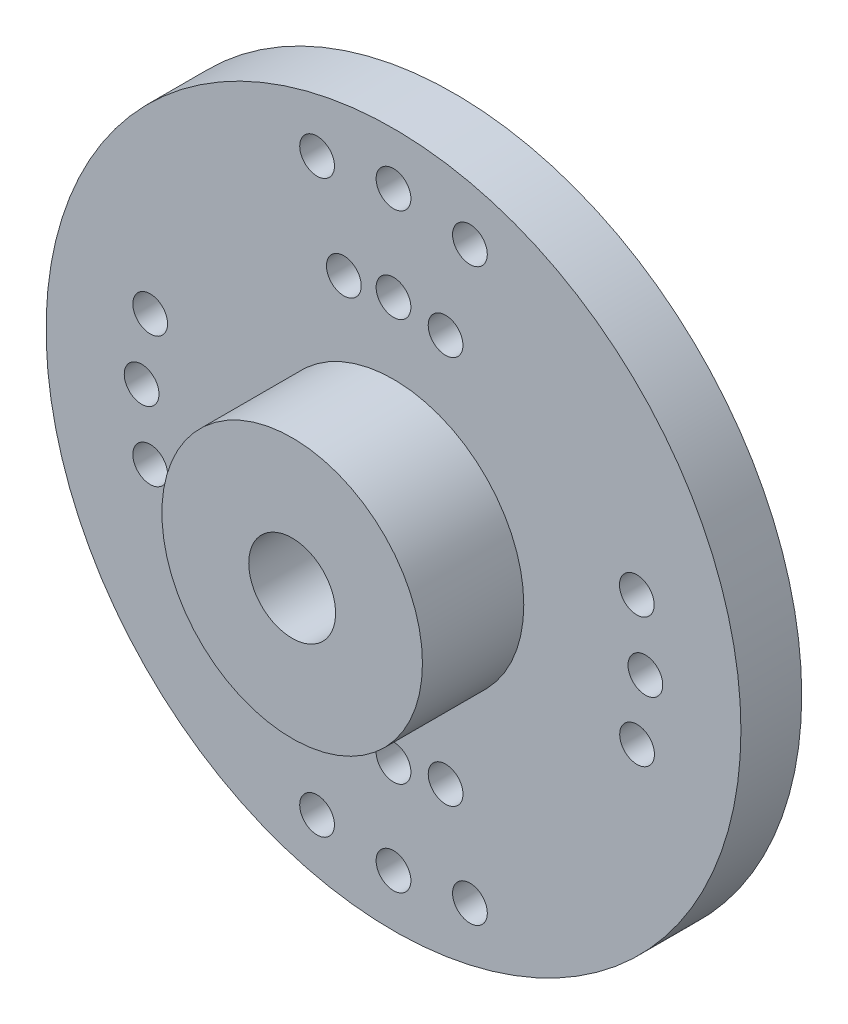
ISO-10303-21;
HEADER;
FILE_DESCRIPTION(('STEP AP214'),'2;1');
FILE_NAME('part.step','',(''),(''),'','','');
FILE_SCHEMA(('AUTOMOTIVE_DESIGN { 1 0 10303 214 1 1 1 1 }'));
ENDSEC;
DATA;
#1=APPLICATION_CONTEXT('core data for automotive mechanical design processes');
#2=APPLICATION_PROTOCOL_DEFINITION('international standard','automotive_design',2000,#1);
#3=PRODUCT_CONTEXT('',#1,'mechanical');
#4=PRODUCT('Part','Part','',(#3));
#5=PRODUCT_RELATED_PRODUCT_CATEGORY('part','',(#4));
#6=PRODUCT_DEFINITION_FORMATION('','',#4);
#7=PRODUCT_DEFINITION_CONTEXT('part definition',#1,'design');
#8=PRODUCT_DEFINITION('design','',#6,#7);
#9=PRODUCT_DEFINITION_SHAPE('','',#8);
#10=(LENGTH_UNIT() NAMED_UNIT(*) SI_UNIT(.MILLI.,.METRE.));
#11=(NAMED_UNIT(*) PLANE_ANGLE_UNIT() SI_UNIT($,.RADIAN.));
#12=(NAMED_UNIT(*) SI_UNIT($,.STERADIAN.) SOLID_ANGLE_UNIT());
#13=UNCERTAINTY_MEASURE_WITH_UNIT(LENGTH_MEASURE(1.E-05),#10,'distance_accuracy_value','');
#14=(GEOMETRIC_REPRESENTATION_CONTEXT(3) GLOBAL_UNCERTAINTY_ASSIGNED_CONTEXT((#13)) GLOBAL_UNIT_ASSIGNED_CONTEXT((#10,
#11,#12)) REPRESENTATION_CONTEXT('',''));
#15=CARTESIAN_POINT('',(0.,0.,0.));
#16=DIRECTION('',(0.,0.,1.));
#17=DIRECTION('',(1.,0.,0.));
#18=AXIS2_PLACEMENT_3D('',#15,#16,#17);
#19=CARTESIAN_POINT('',(0.,0.,2.1));
#20=DIRECTION('',(0.,0.,1.));
#21=DIRECTION('',(1.,0.,0.));
#22=AXIS2_PLACEMENT_3D('',#19,#20,#21);
#23=PLANE('',#22);
#24=CARTESIAN_POINT('',(-8.40340375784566,-2.25187357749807,2.1));
#25=DIRECTION('',(0.,0.,1.));
#26=DIRECTION('',(1.,0.,0.));
#27=AXIS2_PLACEMENT_3D('',#24,#25,#26);
#28=CIRCLE('',#27,0.6);
#29=CARTESIAN_POINT('',(-7.80340375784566,-2.25187357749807,2.1));
#30=VERTEX_POINT('',#29);
#31=EDGE_CURVE('E159',#30,#30,#28,.T.);
#32=ORIENTED_EDGE('',*,*,#31,.F.);
#33=EDGE_LOOP('',(#32));
#34=FACE_BOUND('',#33,.T.);
#35=CARTESIAN_POINT('',(-8.69989248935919,0.,2.1));
#36=DIRECTION('',(0.,0.,1.));
#37=DIRECTION('',(1.,0.,0.));
#38=AXIS2_PLACEMENT_3D('',#35,#36,#37);
#39=CIRCLE('',#38,0.6);
#40=CARTESIAN_POINT('',(-8.09989248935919,0.,2.1));
#41=VERTEX_POINT('',#40);
#42=EDGE_CURVE('E153',#41,#41,#39,.T.);
#43=ORIENTED_EDGE('',*,*,#42,.F.);
#44=EDGE_LOOP('',(#43));
#45=FACE_BOUND('',#44,.T.);
#46=CARTESIAN_POINT('',(-8.40326249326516,2.25240067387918,2.1));
#47=DIRECTION('',(0.,0.,1.));
#48=DIRECTION('',(1.,0.,0.));
#49=AXIS2_PLACEMENT_3D('',#46,#47,#48);
#50=CIRCLE('',#49,0.6);
#51=CARTESIAN_POINT('',(-7.80326249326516,2.25240067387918,2.1));
#52=VERTEX_POINT('',#51);
#53=EDGE_CURVE('E147',#52,#52,#50,.T.);
#54=ORIENTED_EDGE('',*,*,#53,.F.);
#55=EDGE_LOOP('',(#54));
#56=FACE_BOUND('',#55,.T.);
#57=CARTESIAN_POINT('',(8.41239817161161,-2.21803659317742,2.1));
#58=DIRECTION('',(0.,0.,1.));
#59=DIRECTION('',(1.,0.,0.));
#60=AXIS2_PLACEMENT_3D('',#57,#58,#59);
#61=CIRCLE('',#60,0.6);
#62=CARTESIAN_POINT('',(9.01239817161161,-2.21803659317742,2.1));
#63=VERTEX_POINT('',#62);
#64=EDGE_CURVE('E141',#63,#63,#61,.T.);
#65=ORIENTED_EDGE('',*,*,#64,.F.);
#66=EDGE_LOOP('',(#65));
#67=FACE_BOUND('',#66,.T.);
#68=CARTESIAN_POINT('',(8.69989248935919,0.,2.1));
#69=DIRECTION('',(0.,0.,1.));
#70=DIRECTION('',(1.,0.,0.));
#71=AXIS2_PLACEMENT_3D('',#68,#69,#70);
#72=CIRCLE('',#71,0.6);
#73=CARTESIAN_POINT('',(9.29989248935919,0.,2.1));
#74=VERTEX_POINT('',#73);
#75=EDGE_CURVE('E135',#74,#74,#72,.T.);
#76=ORIENTED_EDGE('',*,*,#75,.F.);
#77=EDGE_LOOP('',(#76));
#78=FACE_BOUND('',#77,.T.);
#79=CARTESIAN_POINT('',(8.40349792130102,2.25152215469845,2.1));
#80=DIRECTION('',(0.,0.,1.));
#81=DIRECTION('',(1.,0.,0.));
#82=AXIS2_PLACEMENT_3D('',#79,#80,#81);
#83=CIRCLE('',#82,0.6);
#84=CARTESIAN_POINT('',(9.00349792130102,2.25152215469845,2.1));
#85=VERTEX_POINT('',#84);
#86=EDGE_CURVE('E129',#85,#85,#83,.T.);
#87=ORIENTED_EDGE('',*,*,#86,.F.);
#88=EDGE_LOOP('',(#87));
#89=FACE_BOUND('',#88,.T.);
#90=CARTESIAN_POINT('',(0.,-6.95,2.1));
#91=DIRECTION('',(0.,0.,1.));
#92=DIRECTION('',(1.,0.,0.));
#93=AXIS2_PLACEMENT_3D('',#90,#91,#92);
#94=CIRCLE('',#93,0.6);
#95=CARTESIAN_POINT('',(0.6,-6.95,2.1));
#96=VERTEX_POINT('',#95);
#97=EDGE_CURVE('E123',#96,#96,#94,.T.);
#98=ORIENTED_EDGE('',*,*,#97,.F.);
#99=EDGE_LOOP('',(#98));
#100=FACE_BOUND('',#99,.T.);
#101=CARTESIAN_POINT('',(-1.79880921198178,-6.71317997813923,2.1));
#102=DIRECTION('',(0.,0.,1.));
#103=DIRECTION('',(1.,0.,0.));
#104=AXIS2_PLACEMENT_3D('',#101,#102,#103);
#105=CIRCLE('',#104,0.6);
#106=CARTESIAN_POINT('',(-1.19880921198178,-6.71317997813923,2.1));
#107=VERTEX_POINT('',#106);
#108=EDGE_CURVE('E117',#107,#107,#105,.T.);
#109=ORIENTED_EDGE('',*,*,#108,.F.);
#110=EDGE_LOOP('',(#109));
#111=FACE_BOUND('',#110,.T.);
#112=CARTESIAN_POINT('',(1.79919537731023,-6.71307649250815,2.1));
#113=DIRECTION('',(0.,0.,1.));
#114=DIRECTION('',(1.,0.,0.));
#115=AXIS2_PLACEMENT_3D('',#112,#113,#114);
#116=CIRCLE('',#115,0.6);
#117=CARTESIAN_POINT('',(2.39919537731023,-6.71307649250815,2.1));
#118=VERTEX_POINT('',#117);
#119=EDGE_CURVE('E111',#118,#118,#116,.T.);
#120=ORIENTED_EDGE('',*,*,#119,.F.);
#121=EDGE_LOOP('',(#120));
#122=FACE_BOUND('',#121,.T.);
#123=CARTESIAN_POINT('',(-1.71522814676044,6.73501985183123,2.1));
#124=DIRECTION('',(0.,0.,1.));
#125=DIRECTION('',(1.,0.,0.));
#126=AXIS2_PLACEMENT_3D('',#123,#124,#125);
#127=CIRCLE('',#126,0.6);
#128=CARTESIAN_POINT('',(-1.11522814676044,6.73501985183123,2.1));
#129=VERTEX_POINT('',#128);
#130=EDGE_CURVE('E105',#129,#129,#127,.T.);
#131=ORIENTED_EDGE('',*,*,#130,.F.);
#132=EDGE_LOOP('',(#131));
#133=FACE_BOUND('',#132,.T.);
#134=CARTESIAN_POINT('',(0.,6.95,2.1));
#135=DIRECTION('',(0.,0.,1.));
#136=DIRECTION('',(1.,0.,0.));
#137=AXIS2_PLACEMENT_3D('',#134,#135,#136);
#138=CIRCLE('',#137,0.6);
#139=CARTESIAN_POINT('',(0.6,6.95,2.1));
#140=VERTEX_POINT('',#139);
#141=EDGE_CURVE('E99',#140,#140,#138,.T.);
#142=ORIENTED_EDGE('',*,*,#141,.F.);
#143=EDGE_LOOP('',(#142));
#144=FACE_BOUND('',#143,.T.);
#145=CARTESIAN_POINT('',(1.79877551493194,6.71318900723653,2.1));
#146=DIRECTION('',(0.,0.,1.));
#147=DIRECTION('',(1.,0.,0.));
#148=AXIS2_PLACEMENT_3D('',#145,#146,#147);
#149=CIRCLE('',#148,0.6);
#150=CARTESIAN_POINT('',(2.39877551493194,6.71318900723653,2.1));
#151=VERTEX_POINT('',#150);
#152=EDGE_CURVE('E93',#151,#151,#149,.T.);
#153=ORIENTED_EDGE('',*,*,#152,.F.);
#154=EDGE_LOOP('',(#153));
#155=FACE_BOUND('',#154,.T.);
#156=CARTESIAN_POINT('',(-2.63997110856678,-9.85243891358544,2.1));
#157=DIRECTION('',(0.,0.,1.));
#158=DIRECTION('',(1.,0.,0.));
#159=AXIS2_PLACEMENT_3D('',#156,#157,#158);
#160=CIRCLE('',#159,0.6);
#161=CARTESIAN_POINT('',(-2.03997110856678,-9.85243891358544,2.1));
#162=VERTEX_POINT('',#161);
#163=EDGE_CURVE('E87',#162,#162,#160,.T.);
#164=ORIENTED_EDGE('',*,*,#163,.F.);
#165=EDGE_LOOP('',(#164));
#166=FACE_BOUND('',#165,.T.);
#167=CARTESIAN_POINT('',(0.,-10.2,2.1));
#168=DIRECTION('',(0.,0.,1.));
#169=DIRECTION('',(1.,0.,0.));
#170=AXIS2_PLACEMENT_3D('',#167,#168,#169);
#171=CIRCLE('',#170,0.6);
#172=CARTESIAN_POINT('',(0.599999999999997,-10.2,2.1));
#173=VERTEX_POINT('',#172);
#174=EDGE_CURVE('E81',#173,#173,#171,.T.);
#175=ORIENTED_EDGE('',*,*,#174,.F.);
#176=EDGE_LOOP('',(#175));
#177=FACE_BOUND('',#176,.T.);
#178=CARTESIAN_POINT('',(2.64035727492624,-9.85233543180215,2.1));
#179=DIRECTION('',(0.,0.,1.));
#180=DIRECTION('',(1.,0.,0.));
#181=AXIS2_PLACEMENT_3D('',#178,#179,#180);
#182=CIRCLE('',#181,0.6);
#183=CARTESIAN_POINT('',(3.24035727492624,-9.85233543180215,2.1));
#184=VERTEX_POINT('',#183);
#185=EDGE_CURVE('E75',#184,#184,#182,.T.);
#186=ORIENTED_EDGE('',*,*,#185,.F.);
#187=EDGE_LOOP('',(#186));
#188=FACE_BOUND('',#187,.T.);
#189=CARTESIAN_POINT('',(-2.63955124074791,9.8525514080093,2.1));
#190=DIRECTION('',(0.,0.,1.));
#191=DIRECTION('',(1.,0.,0.));
#192=AXIS2_PLACEMENT_3D('',#189,#190,#191);
#193=CIRCLE('',#192,0.6);
#194=CARTESIAN_POINT('',(-2.03955124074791,9.8525514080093,2.1));
#195=VERTEX_POINT('',#194);
#196=EDGE_CURVE('E69',#195,#195,#193,.T.);
#197=ORIENTED_EDGE('',*,*,#196,.F.);
#198=EDGE_LOOP('',(#197));
#199=FACE_BOUND('',#198,.T.);
#200=CARTESIAN_POINT('',(0.,10.2,2.1));
#201=DIRECTION('',(0.,0.,1.));
#202=DIRECTION('',(1.,0.,0.));
#203=AXIS2_PLACEMENT_3D('',#200,#201,#202);
#204=CIRCLE('',#203,0.6);
#205=CARTESIAN_POINT('',(0.6,10.2,2.1));
#206=VERTEX_POINT('',#205);
#207=EDGE_CURVE('E63',#206,#206,#204,.T.);
#208=ORIENTED_EDGE('',*,*,#207,.F.);
#209=EDGE_LOOP('',(#208));
#210=FACE_BOUND('',#209,.T.);
#211=CARTESIAN_POINT('',(2.63993741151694,9.85244794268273,2.1));
#212=DIRECTION('',(0.,0.,1.));
#213=DIRECTION('',(1.,0.,0.));
#214=AXIS2_PLACEMENT_3D('',#211,#212,#213);
#215=CIRCLE('',#214,0.6);
#216=CARTESIAN_POINT('',(3.23993741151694,9.85244794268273,2.1));
#217=VERTEX_POINT('',#216);
#218=EDGE_CURVE('E57',#217,#217,#215,.T.);
#219=ORIENTED_EDGE('',*,*,#218,.F.);
#220=EDGE_LOOP('',(#219));
#221=FACE_BOUND('',#220,.T.);
#222=CARTESIAN_POINT('',(0.,0.,2.1));
#223=DIRECTION('',(0.,0.,1.));
#224=DIRECTION('',(1.,0.,0.));
#225=AXIS2_PLACEMENT_3D('',#222,#223,#224);
#226=CIRCLE('',#225,12.);
#227=CARTESIAN_POINT('',(12.,0.,2.1));
#228=VERTEX_POINT('',#227);
#229=EDGE_CURVE('E10',#228,#228,#226,.T.);
#230=ORIENTED_EDGE('',*,*,#229,.T.);
#231=EDGE_LOOP('',(#230));
#232=FACE_BOUND('',#231,.T.);
#233=CARTESIAN_POINT('',(0.,0.,2.1));
#234=DIRECTION('',(0.,0.,1.));
#235=DIRECTION('',(1.,0.,0.));
#236=AXIS2_PLACEMENT_3D('',#233,#234,#235);
#237=CIRCLE('',#236,4.5);
#238=CARTESIAN_POINT('',(4.5,0.,2.1));
#239=VERTEX_POINT('',#238);
#240=EDGE_CURVE('E46',#239,#239,#237,.T.);
#241=ORIENTED_EDGE('',*,*,#240,.F.);
#242=EDGE_LOOP('',(#241));
#243=FACE_BOUND('',#242,.T.);
#244=ADVANCED_FACE('F31',(#34,#45,#56,#67,#78,#89,#100,#111,#122,#133,#144,#155,#166,#177,#188,
#199,#210,#221,#232,#243),#23,.T.);
#245=CARTESIAN_POINT('',(0.,0.,2.1));
#246=DIRECTION('',(0.,0.,-1.));
#247=DIRECTION('',(-1.,0.,0.));
#248=AXIS2_PLACEMENT_3D('',#245,#246,#247);
#249=CYLINDRICAL_SURFACE('',#248,12.);
#250=ORIENTED_EDGE('',*,*,#229,.F.);
#251=EDGE_LOOP('',(#250));
#252=FACE_BOUND('',#251,.T.);
#253=CARTESIAN_POINT('',(0.,0.,0.));
#254=DIRECTION('',(0.,0.,1.));
#255=DIRECTION('',(1.,0.,0.));
#256=AXIS2_PLACEMENT_3D('',#253,#254,#255);
#257=CIRCLE('',#256,12.);
#258=CARTESIAN_POINT('',(12.,0.,0.));
#259=VERTEX_POINT('',#258);
#260=EDGE_CURVE('E38',#259,#259,#257,.T.);
#261=ORIENTED_EDGE('',*,*,#260,.T.);
#262=EDGE_LOOP('',(#261));
#263=FACE_BOUND('',#262,.T.);
#264=ADVANCED_FACE('F33',(#252,#263),#249,.T.);
#265=CARTESIAN_POINT('',(0.,0.,0.));
#266=DIRECTION('',(0.,0.,1.));
#267=DIRECTION('',(1.,0.,0.));
#268=AXIS2_PLACEMENT_3D('',#265,#266,#267);
#269=PLANE('',#268);
#270=CARTESIAN_POINT('',(-8.40340375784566,-2.25187357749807,0.));
#271=DIRECTION('',(0.,0.,-1.));
#272=DIRECTION('',(-1.,0.,0.));
#273=AXIS2_PLACEMENT_3D('',#270,#271,#272);
#274=CIRCLE('',#273,0.6);
#275=CARTESIAN_POINT('',(-9.00340375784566,-2.25187357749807,0.));
#276=VERTEX_POINT('',#275);
#277=EDGE_CURVE('E162',#276,#276,#274,.T.);
#278=ORIENTED_EDGE('',*,*,#277,.F.);
#279=EDGE_LOOP('',(#278));
#280=FACE_BOUND('',#279,.T.);
#281=CARTESIAN_POINT('',(-8.69989248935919,0.,0.));
#282=DIRECTION('',(0.,0.,-1.));
#283=DIRECTION('',(-1.,0.,0.));
#284=AXIS2_PLACEMENT_3D('',#281,#282,#283);
#285=CIRCLE('',#284,0.6);
#286=CARTESIAN_POINT('',(-9.29989248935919,0.,0.));
#287=VERTEX_POINT('',#286);
#288=EDGE_CURVE('E156',#287,#287,#285,.T.);
#289=ORIENTED_EDGE('',*,*,#288,.F.);
#290=EDGE_LOOP('',(#289));
#291=FACE_BOUND('',#290,.T.);
#292=CARTESIAN_POINT('',(-8.40326249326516,2.25240067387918,0.));
#293=DIRECTION('',(0.,0.,-1.));
#294=DIRECTION('',(-1.,0.,0.));
#295=AXIS2_PLACEMENT_3D('',#292,#293,#294);
#296=CIRCLE('',#295,0.6);
#297=CARTESIAN_POINT('',(-9.00326249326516,2.25240067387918,0.));
#298=VERTEX_POINT('',#297);
#299=EDGE_CURVE('E150',#298,#298,#296,.T.);
#300=ORIENTED_EDGE('',*,*,#299,.F.);
#301=EDGE_LOOP('',(#300));
#302=FACE_BOUND('',#301,.T.);
#303=CARTESIAN_POINT('',(8.41239817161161,-2.21803659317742,0.));
#304=DIRECTION('',(0.,0.,-1.));
#305=DIRECTION('',(-1.,0.,0.));
#306=AXIS2_PLACEMENT_3D('',#303,#304,#305);
#307=CIRCLE('',#306,0.6);
#308=CARTESIAN_POINT('',(7.81239817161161,-2.21803659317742,0.));
#309=VERTEX_POINT('',#308);
#310=EDGE_CURVE('E144',#309,#309,#307,.T.);
#311=ORIENTED_EDGE('',*,*,#310,.F.);
#312=EDGE_LOOP('',(#311));
#313=FACE_BOUND('',#312,.T.);
#314=CARTESIAN_POINT('',(8.69989248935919,0.,0.));
#315=DIRECTION('',(0.,0.,-1.));
#316=DIRECTION('',(-1.,0.,0.));
#317=AXIS2_PLACEMENT_3D('',#314,#315,#316);
#318=CIRCLE('',#317,0.6);
#319=CARTESIAN_POINT('',(8.09989248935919,0.,0.));
#320=VERTEX_POINT('',#319);
#321=EDGE_CURVE('E138',#320,#320,#318,.T.);
#322=ORIENTED_EDGE('',*,*,#321,.F.);
#323=EDGE_LOOP('',(#322));
#324=FACE_BOUND('',#323,.T.);
#325=CARTESIAN_POINT('',(8.40349792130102,2.25152215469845,0.));
#326=DIRECTION('',(0.,0.,-1.));
#327=DIRECTION('',(-1.,0.,0.));
#328=AXIS2_PLACEMENT_3D('',#325,#326,#327);
#329=CIRCLE('',#328,0.6);
#330=CARTESIAN_POINT('',(7.80349792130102,2.25152215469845,0.));
#331=VERTEX_POINT('',#330);
#332=EDGE_CURVE('E132',#331,#331,#329,.T.);
#333=ORIENTED_EDGE('',*,*,#332,.F.);
#334=EDGE_LOOP('',(#333));
#335=FACE_BOUND('',#334,.T.);
#336=CARTESIAN_POINT('',(0.,-6.95,0.));
#337=DIRECTION('',(0.,0.,-1.));
#338=DIRECTION('',(-1.,0.,0.));
#339=AXIS2_PLACEMENT_3D('',#336,#337,#338);
#340=CIRCLE('',#339,0.6);
#341=CARTESIAN_POINT('',(-0.6,-6.95,0.));
#342=VERTEX_POINT('',#341);
#343=EDGE_CURVE('E126',#342,#342,#340,.T.);
#344=ORIENTED_EDGE('',*,*,#343,.F.);
#345=EDGE_LOOP('',(#344));
#346=FACE_BOUND('',#345,.T.);
#347=CARTESIAN_POINT('',(-1.79880921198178,-6.71317997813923,0.));
#348=DIRECTION('',(0.,0.,-1.));
#349=DIRECTION('',(-1.,0.,0.));
#350=AXIS2_PLACEMENT_3D('',#347,#348,#349);
#351=CIRCLE('',#350,0.6);
#352=CARTESIAN_POINT('',(-2.39880921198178,-6.71317997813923,0.));
#353=VERTEX_POINT('',#352);
#354=EDGE_CURVE('E120',#353,#353,#351,.T.);
#355=ORIENTED_EDGE('',*,*,#354,.F.);
#356=EDGE_LOOP('',(#355));
#357=FACE_BOUND('',#356,.T.);
#358=CARTESIAN_POINT('',(1.79919537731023,-6.71307649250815,0.));
#359=DIRECTION('',(0.,0.,-1.));
#360=DIRECTION('',(-1.,0.,0.));
#361=AXIS2_PLACEMENT_3D('',#358,#359,#360);
#362=CIRCLE('',#361,0.6);
#363=CARTESIAN_POINT('',(1.19919537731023,-6.71307649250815,0.));
#364=VERTEX_POINT('',#363);
#365=EDGE_CURVE('E114',#364,#364,#362,.T.);
#366=ORIENTED_EDGE('',*,*,#365,.F.);
#367=EDGE_LOOP('',(#366));
#368=FACE_BOUND('',#367,.T.);
#369=CARTESIAN_POINT('',(-1.71522814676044,6.73501985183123,0.));
#370=DIRECTION('',(0.,0.,-1.));
#371=DIRECTION('',(-1.,0.,0.));
#372=AXIS2_PLACEMENT_3D('',#369,#370,#371);
#373=CIRCLE('',#372,0.6);
#374=CARTESIAN_POINT('',(-2.31522814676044,6.73501985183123,0.));
#375=VERTEX_POINT('',#374);
#376=EDGE_CURVE('E108',#375,#375,#373,.T.);
#377=ORIENTED_EDGE('',*,*,#376,.F.);
#378=EDGE_LOOP('',(#377));
#379=FACE_BOUND('',#378,.T.);
#380=CARTESIAN_POINT('',(0.,6.95,0.));
#381=DIRECTION('',(0.,0.,-1.));
#382=DIRECTION('',(-1.,0.,0.));
#383=AXIS2_PLACEMENT_3D('',#380,#381,#382);
#384=CIRCLE('',#383,0.6);
#385=CARTESIAN_POINT('',(-0.6,6.95,0.));
#386=VERTEX_POINT('',#385);
#387=EDGE_CURVE('E102',#386,#386,#384,.T.);
#388=ORIENTED_EDGE('',*,*,#387,.F.);
#389=EDGE_LOOP('',(#388));
#390=FACE_BOUND('',#389,.T.);
#391=CARTESIAN_POINT('',(1.79877551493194,6.71318900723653,0.));
#392=DIRECTION('',(0.,0.,-1.));
#393=DIRECTION('',(-1.,0.,0.));
#394=AXIS2_PLACEMENT_3D('',#391,#392,#393);
#395=CIRCLE('',#394,0.6);
#396=CARTESIAN_POINT('',(1.19877551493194,6.71318900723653,0.));
#397=VERTEX_POINT('',#396);
#398=EDGE_CURVE('E96',#397,#397,#395,.T.);
#399=ORIENTED_EDGE('',*,*,#398,.F.);
#400=EDGE_LOOP('',(#399));
#401=FACE_BOUND('',#400,.T.);
#402=CARTESIAN_POINT('',(-2.63997110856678,-9.85243891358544,0.));
#403=DIRECTION('',(0.,0.,-1.));
#404=DIRECTION('',(-1.,0.,0.));
#405=AXIS2_PLACEMENT_3D('',#402,#403,#404);
#406=CIRCLE('',#405,0.6);
#407=CARTESIAN_POINT('',(-3.23997110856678,-9.85243891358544,0.));
#408=VERTEX_POINT('',#407);
#409=EDGE_CURVE('E90',#408,#408,#406,.T.);
#410=ORIENTED_EDGE('',*,*,#409,.F.);
#411=EDGE_LOOP('',(#410));
#412=FACE_BOUND('',#411,.T.);
#413=CARTESIAN_POINT('',(0.,-10.2,0.));
#414=DIRECTION('',(0.,0.,-1.));
#415=DIRECTION('',(-1.,0.,0.));
#416=AXIS2_PLACEMENT_3D('',#413,#414,#415);
#417=CIRCLE('',#416,0.6);
#418=CARTESIAN_POINT('',(-0.600000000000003,-10.2,0.));
#419=VERTEX_POINT('',#418);
#420=EDGE_CURVE('E84',#419,#419,#417,.T.);
#421=ORIENTED_EDGE('',*,*,#420,.F.);
#422=EDGE_LOOP('',(#421));
#423=FACE_BOUND('',#422,.T.);
#424=CARTESIAN_POINT('',(2.64035727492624,-9.85233543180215,0.));
#425=DIRECTION('',(0.,0.,-1.));
#426=DIRECTION('',(-1.,0.,0.));
#427=AXIS2_PLACEMENT_3D('',#424,#425,#426);
#428=CIRCLE('',#427,0.6);
#429=CARTESIAN_POINT('',(2.04035727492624,-9.85233543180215,0.));
#430=VERTEX_POINT('',#429);
#431=EDGE_CURVE('E78',#430,#430,#428,.T.);
#432=ORIENTED_EDGE('',*,*,#431,.F.);
#433=EDGE_LOOP('',(#432));
#434=FACE_BOUND('',#433,.T.);
#435=CARTESIAN_POINT('',(-2.63955124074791,9.8525514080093,0.));
#436=DIRECTION('',(0.,0.,-1.));
#437=DIRECTION('',(-1.,0.,0.));
#438=AXIS2_PLACEMENT_3D('',#435,#436,#437);
#439=CIRCLE('',#438,0.6);
#440=CARTESIAN_POINT('',(-3.23955124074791,9.8525514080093,0.));
#441=VERTEX_POINT('',#440);
#442=EDGE_CURVE('E72',#441,#441,#439,.T.);
#443=ORIENTED_EDGE('',*,*,#442,.F.);
#444=EDGE_LOOP('',(#443));
#445=FACE_BOUND('',#444,.T.);
#446=CARTESIAN_POINT('',(0.,10.2,0.));
#447=DIRECTION('',(0.,0.,-1.));
#448=DIRECTION('',(-1.,0.,0.));
#449=AXIS2_PLACEMENT_3D('',#446,#447,#448);
#450=CIRCLE('',#449,0.6);
#451=CARTESIAN_POINT('',(-0.6,10.2,0.));
#452=VERTEX_POINT('',#451);
#453=EDGE_CURVE('E66',#452,#452,#450,.T.);
#454=ORIENTED_EDGE('',*,*,#453,.F.);
#455=EDGE_LOOP('',(#454));
#456=FACE_BOUND('',#455,.T.);
#457=CARTESIAN_POINT('',(2.63993741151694,9.85244794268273,0.));
#458=DIRECTION('',(0.,0.,-1.));
#459=DIRECTION('',(-1.,0.,0.));
#460=AXIS2_PLACEMENT_3D('',#457,#458,#459);
#461=CIRCLE('',#460,0.6);
#462=CARTESIAN_POINT('',(2.03993741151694,9.85244794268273,0.));
#463=VERTEX_POINT('',#462);
#464=EDGE_CURVE('E60',#463,#463,#461,.T.);
#465=ORIENTED_EDGE('',*,*,#464,.F.);
#466=EDGE_LOOP('',(#465));
#467=FACE_BOUND('',#466,.T.);
#468=CARTESIAN_POINT('',(0.,0.,0.));
#469=DIRECTION('',(0.,0.,-1.));
#470=DIRECTION('',(-1.,0.,0.));
#471=AXIS2_PLACEMENT_3D('',#468,#469,#470);
#472=CIRCLE('',#471,1.5);
#473=CARTESIAN_POINT('',(-1.5,0.,0.));
#474=VERTEX_POINT('',#473);
#475=EDGE_CURVE('E54',#474,#474,#472,.T.);
#476=ORIENTED_EDGE('',*,*,#475,.F.);
#477=EDGE_LOOP('',(#476));
#478=FACE_BOUND('',#477,.T.);
#479=ORIENTED_EDGE('',*,*,#260,.F.);
#480=EDGE_LOOP('',(#479));
#481=FACE_BOUND('',#480,.T.);
#482=ADVANCED_FACE('F168',(#280,#291,#302,#313,#324,#335,#346,#357,#368,#379,#390,#401,#412,
#423,#434,#445,#456,#467,#478,#481),#269,.F.);
#483=CARTESIAN_POINT('',(0.,0.,5.6));
#484=DIRECTION('',(0.,0.,-1.));
#485=DIRECTION('',(-1.,0.,0.));
#486=AXIS2_PLACEMENT_3D('',#483,#484,#485);
#487=CYLINDRICAL_SURFACE('',#486,4.5);
#488=CARTESIAN_POINT('',(0.,0.,5.6));
#489=DIRECTION('',(0.,0.,1.));
#490=DIRECTION('',(1.,0.,0.));
#491=AXIS2_PLACEMENT_3D('',#488,#489,#490);
#492=CIRCLE('',#491,4.5);
#493=CARTESIAN_POINT('',(4.5,0.,5.6));
#494=VERTEX_POINT('',#493);
#495=EDGE_CURVE('E42',#494,#494,#492,.T.);
#496=ORIENTED_EDGE('',*,*,#495,.F.);
#497=EDGE_LOOP('',(#496));
#498=FACE_BOUND('',#497,.T.);
#499=ORIENTED_EDGE('',*,*,#240,.T.);
#500=EDGE_LOOP('',(#499));
#501=FACE_BOUND('',#500,.T.);
#502=ADVANCED_FACE('F171',(#498,#501),#487,.T.);
#503=CARTESIAN_POINT('',(0.,0.,5.6));
#504=DIRECTION('',(0.,0.,1.));
#505=DIRECTION('',(1.,0.,0.));
#506=AXIS2_PLACEMENT_3D('',#503,#504,#505);
#507=PLANE('',#506);
#508=CARTESIAN_POINT('',(0.,0.,5.6));
#509=DIRECTION('',(0.,0.,-1.));
#510=DIRECTION('',(-1.,0.,0.));
#511=AXIS2_PLACEMENT_3D('',#508,#509,#510);
#512=CIRCLE('',#511,1.5);
#513=CARTESIAN_POINT('',(-1.5,0.,5.6));
#514=VERTEX_POINT('',#513);
#515=EDGE_CURVE('E51',#514,#514,#512,.T.);
#516=ORIENTED_EDGE('',*,*,#515,.T.);
#517=EDGE_LOOP('',(#516));
#518=FACE_BOUND('',#517,.T.);
#519=ORIENTED_EDGE('',*,*,#495,.T.);
#520=EDGE_LOOP('',(#519));
#521=FACE_BOUND('',#520,.T.);
#522=ADVANCED_FACE('F213',(#518,#521),#507,.T.);
#523=CARTESIAN_POINT('',(0.,0.,5.6));
#524=DIRECTION('',(0.,0.,-1.));
#525=DIRECTION('',(-1.,0.,0.));
#526=AXIS2_PLACEMENT_3D('',#523,#524,#525);
#527=CYLINDRICAL_SURFACE('',#526,1.5);
#528=ORIENTED_EDGE('',*,*,#515,.F.);
#529=EDGE_LOOP('',(#528));
#530=FACE_BOUND('',#529,.T.);
#531=ORIENTED_EDGE('',*,*,#475,.T.);
#532=EDGE_LOOP('',(#531));
#533=FACE_BOUND('',#532,.T.);
#534=ADVANCED_FACE('F210',(#530,#533),#527,.F.);
#535=CARTESIAN_POINT('',(2.63993741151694,9.85244794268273,5.6));
#536=DIRECTION('',(0.,0.,-1.));
#537=DIRECTION('',(-1.,0.,0.));
#538=AXIS2_PLACEMENT_3D('',#535,#536,#537);
#539=CYLINDRICAL_SURFACE('',#538,0.6);
#540=ORIENTED_EDGE('',*,*,#218,.T.);
#541=EDGE_LOOP('',(#540));
#542=FACE_BOUND('',#541,.T.);
#543=ORIENTED_EDGE('',*,*,#464,.T.);
#544=EDGE_LOOP('',(#543));
#545=FACE_BOUND('',#544,.T.);
#546=ADVANCED_FACE('F212',(#542,#545),#539,.F.);
#547=CARTESIAN_POINT('',(0.,10.2,5.6));
#548=DIRECTION('',(0.,0.,-1.));
#549=DIRECTION('',(-1.,0.,0.));
#550=AXIS2_PLACEMENT_3D('',#547,#548,#549);
#551=CYLINDRICAL_SURFACE('',#550,0.6);
#552=ORIENTED_EDGE('',*,*,#207,.T.);
#553=EDGE_LOOP('',(#552));
#554=FACE_BOUND('',#553,.T.);
#555=ORIENTED_EDGE('',*,*,#453,.T.);
#556=EDGE_LOOP('',(#555));
#557=FACE_BOUND('',#556,.T.);
#558=ADVANCED_FACE('F220',(#554,#557),#551,.F.);
#559=CARTESIAN_POINT('',(-2.63955124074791,9.8525514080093,5.6));
#560=DIRECTION('',(0.,0.,-1.));
#561=DIRECTION('',(-1.,0.,0.));
#562=AXIS2_PLACEMENT_3D('',#559,#560,#561);
#563=CYLINDRICAL_SURFACE('',#562,0.6);
#564=ORIENTED_EDGE('',*,*,#196,.T.);
#565=EDGE_LOOP('',(#564));
#566=FACE_BOUND('',#565,.T.);
#567=ORIENTED_EDGE('',*,*,#442,.T.);
#568=EDGE_LOOP('',(#567));
#569=FACE_BOUND('',#568,.T.);
#570=ADVANCED_FACE('F272',(#566,#569),#563,.F.);
#571=CARTESIAN_POINT('',(2.64035727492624,-9.85233543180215,5.6));
#572=DIRECTION('',(0.,0.,-1.));
#573=DIRECTION('',(-1.,0.,0.));
#574=AXIS2_PLACEMENT_3D('',#571,#572,#573);
#575=CYLINDRICAL_SURFACE('',#574,0.6);
#576=ORIENTED_EDGE('',*,*,#185,.T.);
#577=EDGE_LOOP('',(#576));
#578=FACE_BOUND('',#577,.T.);
#579=ORIENTED_EDGE('',*,*,#431,.T.);
#580=EDGE_LOOP('',(#579));
#581=FACE_BOUND('',#580,.T.);
#582=ADVANCED_FACE('F282',(#578,#581),#575,.F.);
#583=CARTESIAN_POINT('',(0.,-10.2,5.6));
#584=DIRECTION('',(0.,0.,-1.));
#585=DIRECTION('',(-1.,0.,0.));
#586=AXIS2_PLACEMENT_3D('',#583,#584,#585);
#587=CYLINDRICAL_SURFACE('',#586,0.6);
#588=ORIENTED_EDGE('',*,*,#174,.T.);
#589=EDGE_LOOP('',(#588));
#590=FACE_BOUND('',#589,.T.);
#591=ORIENTED_EDGE('',*,*,#420,.T.);
#592=EDGE_LOOP('',(#591));
#593=FACE_BOUND('',#592,.T.);
#594=ADVANCED_FACE('F292',(#590,#593),#587,.F.);
#595=CARTESIAN_POINT('',(-2.63997110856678,-9.85243891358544,5.6));
#596=DIRECTION('',(0.,0.,-1.));
#597=DIRECTION('',(-1.,0.,0.));
#598=AXIS2_PLACEMENT_3D('',#595,#596,#597);
#599=CYLINDRICAL_SURFACE('',#598,0.6);
#600=ORIENTED_EDGE('',*,*,#163,.T.);
#601=EDGE_LOOP('',(#600));
#602=FACE_BOUND('',#601,.T.);
#603=ORIENTED_EDGE('',*,*,#409,.T.);
#604=EDGE_LOOP('',(#603));
#605=FACE_BOUND('',#604,.T.);
#606=ADVANCED_FACE('F302',(#602,#605),#599,.F.);
#607=CARTESIAN_POINT('',(1.79877551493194,6.71318900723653,5.6));
#608=DIRECTION('',(0.,0.,-1.));
#609=DIRECTION('',(-1.,0.,0.));
#610=AXIS2_PLACEMENT_3D('',#607,#608,#609);
#611=CYLINDRICAL_SURFACE('',#610,0.6);
#612=ORIENTED_EDGE('',*,*,#152,.T.);
#613=EDGE_LOOP('',(#612));
#614=FACE_BOUND('',#613,.T.);
#615=ORIENTED_EDGE('',*,*,#398,.T.);
#616=EDGE_LOOP('',(#615));
#617=FACE_BOUND('',#616,.T.);
#618=ADVANCED_FACE('F312',(#614,#617),#611,.F.);
#619=CARTESIAN_POINT('',(0.,6.95,5.6));
#620=DIRECTION('',(0.,0.,-1.));
#621=DIRECTION('',(-1.,0.,0.));
#622=AXIS2_PLACEMENT_3D('',#619,#620,#621);
#623=CYLINDRICAL_SURFACE('',#622,0.6);
#624=ORIENTED_EDGE('',*,*,#141,.T.);
#625=EDGE_LOOP('',(#624));
#626=FACE_BOUND('',#625,.T.);
#627=ORIENTED_EDGE('',*,*,#387,.T.);
#628=EDGE_LOOP('',(#627));
#629=FACE_BOUND('',#628,.T.);
#630=ADVANCED_FACE('F322',(#626,#629),#623,.F.);
#631=CARTESIAN_POINT('',(-1.71522814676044,6.73501985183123,5.6));
#632=DIRECTION('',(0.,0.,-1.));
#633=DIRECTION('',(-1.,0.,0.));
#634=AXIS2_PLACEMENT_3D('',#631,#632,#633);
#635=CYLINDRICAL_SURFACE('',#634,0.6);
#636=ORIENTED_EDGE('',*,*,#130,.T.);
#637=EDGE_LOOP('',(#636));
#638=FACE_BOUND('',#637,.T.);
#639=ORIENTED_EDGE('',*,*,#376,.T.);
#640=EDGE_LOOP('',(#639));
#641=FACE_BOUND('',#640,.T.);
#642=ADVANCED_FACE('F332',(#638,#641),#635,.F.);
#643=CARTESIAN_POINT('',(1.79919537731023,-6.71307649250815,5.6));
#644=DIRECTION('',(0.,0.,-1.));
#645=DIRECTION('',(-1.,0.,0.));
#646=AXIS2_PLACEMENT_3D('',#643,#644,#645);
#647=CYLINDRICAL_SURFACE('',#646,0.6);
#648=ORIENTED_EDGE('',*,*,#119,.T.);
#649=EDGE_LOOP('',(#648));
#650=FACE_BOUND('',#649,.T.);
#651=ORIENTED_EDGE('',*,*,#365,.T.);
#652=EDGE_LOOP('',(#651));
#653=FACE_BOUND('',#652,.T.);
#654=ADVANCED_FACE('F342',(#650,#653),#647,.F.);
#655=CARTESIAN_POINT('',(-1.79880921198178,-6.71317997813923,5.6));
#656=DIRECTION('',(0.,0.,-1.));
#657=DIRECTION('',(-1.,0.,0.));
#658=AXIS2_PLACEMENT_3D('',#655,#656,#657);
#659=CYLINDRICAL_SURFACE('',#658,0.6);
#660=ORIENTED_EDGE('',*,*,#108,.T.);
#661=EDGE_LOOP('',(#660));
#662=FACE_BOUND('',#661,.T.);
#663=ORIENTED_EDGE('',*,*,#354,.T.);
#664=EDGE_LOOP('',(#663));
#665=FACE_BOUND('',#664,.T.);
#666=ADVANCED_FACE('F352',(#662,#665),#659,.F.);
#667=CARTESIAN_POINT('',(0.,-6.95,5.6));
#668=DIRECTION('',(0.,0.,-1.));
#669=DIRECTION('',(-1.,0.,0.));
#670=AXIS2_PLACEMENT_3D('',#667,#668,#669);
#671=CYLINDRICAL_SURFACE('',#670,0.6);
#672=ORIENTED_EDGE('',*,*,#97,.T.);
#673=EDGE_LOOP('',(#672));
#674=FACE_BOUND('',#673,.T.);
#675=ORIENTED_EDGE('',*,*,#343,.T.);
#676=EDGE_LOOP('',(#675));
#677=FACE_BOUND('',#676,.T.);
#678=ADVANCED_FACE('F362',(#674,#677),#671,.F.);
#679=CARTESIAN_POINT('',(8.40349792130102,2.25152215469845,5.6));
#680=DIRECTION('',(0.,0.,-1.));
#681=DIRECTION('',(-1.,0.,0.));
#682=AXIS2_PLACEMENT_3D('',#679,#680,#681);
#683=CYLINDRICAL_SURFACE('',#682,0.6);
#684=ORIENTED_EDGE('',*,*,#86,.T.);
#685=EDGE_LOOP('',(#684));
#686=FACE_BOUND('',#685,.T.);
#687=ORIENTED_EDGE('',*,*,#332,.T.);
#688=EDGE_LOOP('',(#687));
#689=FACE_BOUND('',#688,.T.);
#690=ADVANCED_FACE('F372',(#686,#689),#683,.F.);
#691=CARTESIAN_POINT('',(8.69989248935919,0.,5.6));
#692=DIRECTION('',(0.,0.,-1.));
#693=DIRECTION('',(-1.,0.,0.));
#694=AXIS2_PLACEMENT_3D('',#691,#692,#693);
#695=CYLINDRICAL_SURFACE('',#694,0.6);
#696=ORIENTED_EDGE('',*,*,#75,.T.);
#697=EDGE_LOOP('',(#696));
#698=FACE_BOUND('',#697,.T.);
#699=ORIENTED_EDGE('',*,*,#321,.T.);
#700=EDGE_LOOP('',(#699));
#701=FACE_BOUND('',#700,.T.);
#702=ADVANCED_FACE('F382',(#698,#701),#695,.F.);
#703=CARTESIAN_POINT('',(8.41239817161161,-2.21803659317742,5.6));
#704=DIRECTION('',(0.,0.,-1.));
#705=DIRECTION('',(-1.,0.,0.));
#706=AXIS2_PLACEMENT_3D('',#703,#704,#705);
#707=CYLINDRICAL_SURFACE('',#706,0.6);
#708=ORIENTED_EDGE('',*,*,#64,.T.);
#709=EDGE_LOOP('',(#708));
#710=FACE_BOUND('',#709,.T.);
#711=ORIENTED_EDGE('',*,*,#310,.T.);
#712=EDGE_LOOP('',(#711));
#713=FACE_BOUND('',#712,.T.);
#714=ADVANCED_FACE('F392',(#710,#713),#707,.F.);
#715=CARTESIAN_POINT('',(-8.40326249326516,2.25240067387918,5.6));
#716=DIRECTION('',(0.,0.,-1.));
#717=DIRECTION('',(-1.,0.,0.));
#718=AXIS2_PLACEMENT_3D('',#715,#716,#717);
#719=CYLINDRICAL_SURFACE('',#718,0.6);
#720=ORIENTED_EDGE('',*,*,#53,.T.);
#721=EDGE_LOOP('',(#720));
#722=FACE_BOUND('',#721,.T.);
#723=ORIENTED_EDGE('',*,*,#299,.T.);
#724=EDGE_LOOP('',(#723));
#725=FACE_BOUND('',#724,.T.);
#726=ADVANCED_FACE('F402',(#722,#725),#719,.F.);
#727=CARTESIAN_POINT('',(-8.69989248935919,0.,5.6));
#728=DIRECTION('',(0.,0.,-1.));
#729=DIRECTION('',(-1.,0.,0.));
#730=AXIS2_PLACEMENT_3D('',#727,#728,#729);
#731=CYLINDRICAL_SURFACE('',#730,0.6);
#732=ORIENTED_EDGE('',*,*,#42,.T.);
#733=EDGE_LOOP('',(#732));
#734=FACE_BOUND('',#733,.T.);
#735=ORIENTED_EDGE('',*,*,#288,.T.);
#736=EDGE_LOOP('',(#735));
#737=FACE_BOUND('',#736,.T.);
#738=ADVANCED_FACE('F412',(#734,#737),#731,.F.);
#739=CARTESIAN_POINT('',(-8.40340375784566,-2.25187357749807,5.6));
#740=DIRECTION('',(0.,0.,-1.));
#741=DIRECTION('',(-1.,0.,0.));
#742=AXIS2_PLACEMENT_3D('',#739,#740,#741);
#743=CYLINDRICAL_SURFACE('',#742,0.6);
#744=ORIENTED_EDGE('',*,*,#31,.T.);
#745=EDGE_LOOP('',(#744));
#746=FACE_BOUND('',#745,.T.);
#747=ORIENTED_EDGE('',*,*,#277,.T.);
#748=EDGE_LOOP('',(#747));
#749=FACE_BOUND('',#748,.T.);
#750=ADVANCED_FACE('F166',(#746,#749),#743,.F.);
#751=CLOSED_SHELL('',(#244,#264,#482,#502,#522,#534,#546,#558,#570,#582,#594,#606,#618,#630,
#642,#654,#666,#678,#690,#702,#714,#726,#738,#750));
#752=MANIFOLD_SOLID_BREP('B2',#751);
#753=ADVANCED_BREP_SHAPE_REPRESENTATION('',(#18,#752),#14);
#754=SHAPE_DEFINITION_REPRESENTATION(#9,#753);
ENDSEC;
END-ISO-10303-21;
